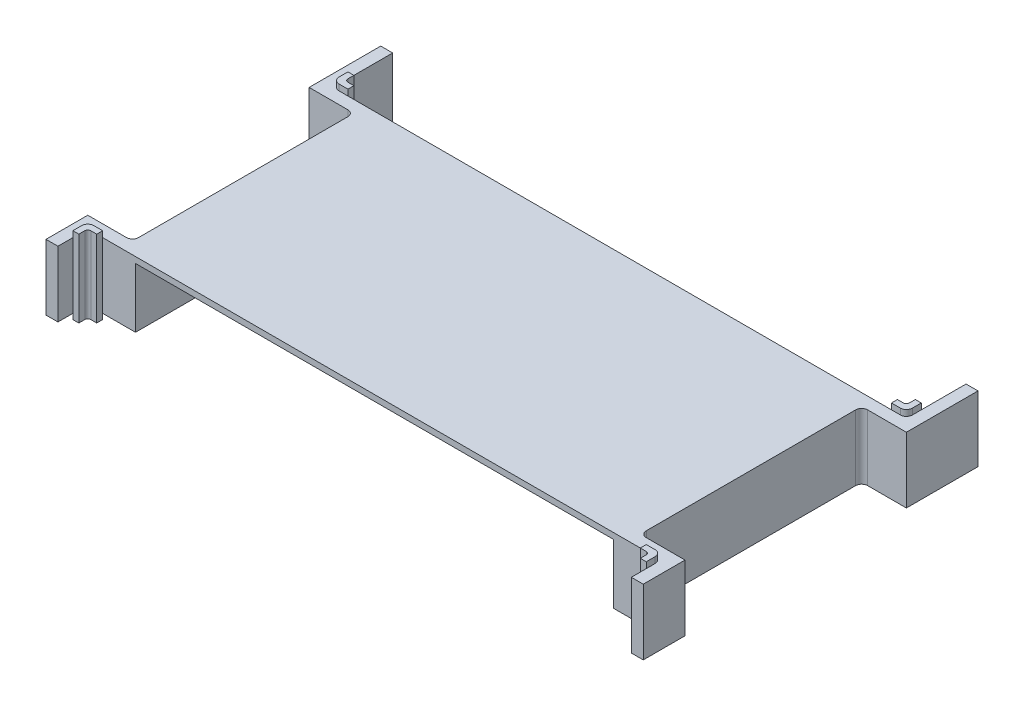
from build123d import *

# Parameters (mm, degrees)
BOSS_EXTRUDE3_DEPTH      = 11
BOSS_EXTRUDE3_2_DEPTH    = 11
SKETCH1_3_W              = 80.1
SKETCH1_3_H              = 41.1
BOSS_EXTRUDE4_DEPTH      = 1
BOSS_EXTRUDE5_DEPTH      = 1
BOSS_EXTRUDE5_DEPTH_BACK = 11.9


with BuildPart() as part:
    # Sketch1 → Boss-Extrude3 (new body)
    with BuildSketch(Plane(origin=(0, 0, 0), x_dir=(1, 0, 0), z_dir=(0, 1, 0))):
        with BuildLine():
            Line((90.1, 46.1), (90.1, 5))
            Line((90.1, 5), (95.6, 5))
            Line((95.6, 5), (97.1, 5))
            ThreePointArc((97.1, 5), (97.807106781, 4.707106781), (98.1, 4))
            Line((98.1, 4), (98.1, 2.5))
            Line((98.1, 2.5), (98.1, 0))
            Line((98.1, 0), (100.1, 0))
            Line((100.1, 0), (100.1, 7))
            Line((100.1, 7), (93.6, 7))
            ThreePointArc((93.6, 7), (92.892893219, 7.292893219), (92.6, 8))
            Line((92.6, 8), (92.6, 43.1))
            ThreePointArc((92.6, 43.1), (92.892893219, 43.807106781), (93.6, 44.1))
            Line((93.6, 44.1), (100.1, 44.1))
            Line((100.1, 44.1), (100.1, 56.1))
            Line((100.1, 56.1), (98.1, 56.1))
            Line((98.1, 56.1), (98.1, 48.6))
            Line((98.1, 48.6), (98.1, 47.1))
            ThreePointArc((98.1, 47.1), (97.807106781, 46.392893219), (97.1, 46.1))
            Line((97.1, 46.1), (95.6, 46.1))
            Line((95.6, 46.1), (90.1, 46.1))
        make_face()
    extrude(amount=-BOSS_EXTRUDE3_DEPTH)



with BuildPart() as body_2:
    # Sketch1 → Boss-Extrude3 2 (new body)
    with BuildSketch(Plane(origin=(0, 0, 0), x_dir=(1, 0, 0), z_dir=(0, 1, 0))):
        with BuildLine():
            Line((0, 7), (0, 0))
            Line((0, 0), (2, 0))
            Line((2, 0), (2, 2.5))
            Line((2, 2.5), (2, 4))
            ThreePointArc((2, 4), (2.292893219, 4.707106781), (3, 5))
            Line((3, 5), (4.5, 5))
            Line((4.5, 5), (10, 5))
            Line((10, 5), (10, 46.1))
            Line((10, 46.1), (4.5, 46.1))
            Line((4.5, 46.1), (3, 46.1))
            ThreePointArc((3, 46.1), (2.292893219, 46.392893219), (2, 47.1))
            Line((2, 47.1), (2, 48.6))
            Line((2, 48.6), (2, 56.1))
            Line((2, 56.1), (0, 56.1))
            Line((0, 56.1), (0, 44.1))
            Line((0, 44.1), (6.5, 44.1))
            ThreePointArc((6.5, 44.1), (7.207106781, 43.807106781), (7.5, 43.1))
            Line((7.5, 43.1), (7.5, 8))
            ThreePointArc((7.5, 8), (7.207106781, 7.292893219), (6.5, 7))
            Line((6.5, 7), (0, 7))
        make_face()
    extrude(amount=-BOSS_EXTRUDE3_2_DEPTH)


with BuildPart() as part_1:
    add(part.part)

    add(body_2.part)  # Boss-Extrude4 merges body 2
    # Sketch1_3 → Boss-Extrude4 (add)
    with BuildSketch(Plane(origin=(0, 0, 0), x_dir=(1, 0, 0), z_dir=(0, 1, 0))):
        with Locations((50.05, 25.55)):
            Rectangle(SKETCH1_3_W, SKETCH1_3_H)
    extrude(amount=-BOSS_EXTRUDE4_DEPTH)

    # Sketch1_4 → Boss-Extrude5 (add, two sides: drawn at the far end of the back side and taken through both)
    with BuildSketch(Plane(origin=(0, 0, 0), x_dir=(1, 0, 0), z_dir=(0, 1, 0)).offset(-BOSS_EXTRUDE5_DEPTH_BACK)):
        with BuildLine():
            Line((97.1, 5), (95.6, 5))
            Line((95.6, 5), (95.6, 4))
            Line((95.6, 4), (96.6, 4))
            ThreePointArc((96.6, 4), (96.953553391, 3.853553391), (97.1, 3.5))
            Line((97.1, 3.5), (97.1, 2.5))
            Line((97.1, 2.5), (98.1, 2.5))
            Line((98.1, 2.5), (98.1, 4))
            ThreePointArc((98.1, 4), (97.807106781, 4.707106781), (97.1, 5))
        make_face()
        with BuildLine():
            Line((95.6, 47.1), (95.6, 46.1))
            Line((95.6, 46.1), (97.1, 46.1))
            ThreePointArc((97.1, 46.1), (97.807106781, 46.392893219), (98.1, 47.1))
            Line((98.1, 47.1), (98.1, 48.6))
            Line((98.1, 48.6), (97.1, 48.6))
            Line((97.1, 48.6), (97.1, 47.6))
            ThreePointArc((97.1, 47.6), (96.953553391, 47.246446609), (96.6, 47.1))
            Line((96.6, 47.1), (95.6, 47.1))
        make_face()
        with BuildLine():
            Line((2, 4), (2, 2.5))
            Line((2, 2.5), (3, 2.5))
            Line((3, 2.5), (3, 3.5))
            ThreePointArc((3, 3.5), (3.146446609, 3.853553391), (3.5, 4))
            Line((3.5, 4), (4.5, 4))
            Line((4.5, 4), (4.5, 5))
            Line((4.5, 5), (3, 5))
            ThreePointArc((3, 5), (2.292893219, 4.707106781), (2, 4))
        make_face()
        with BuildLine():
            Line((3, 46.1), (4.5, 46.1))
            Line((4.5, 46.1), (4.5, 47.1))
            Line((4.5, 47.1), (3.5, 47.1))
            ThreePointArc((3.5, 47.1), (3.146446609, 47.246446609), (3, 47.6))
            Line((3, 47.6), (3, 48.6))
            Line((3, 48.6), (2, 48.6))
            Line((2, 48.6), (2, 47.1))
            ThreePointArc((2, 47.1), (2.292893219, 46.392893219), (3, 46.1))
        make_face()
    extrude(amount=BOSS_EXTRUDE5_DEPTH + BOSS_EXTRUDE5_DEPTH_BACK)


solid = part_1.part
